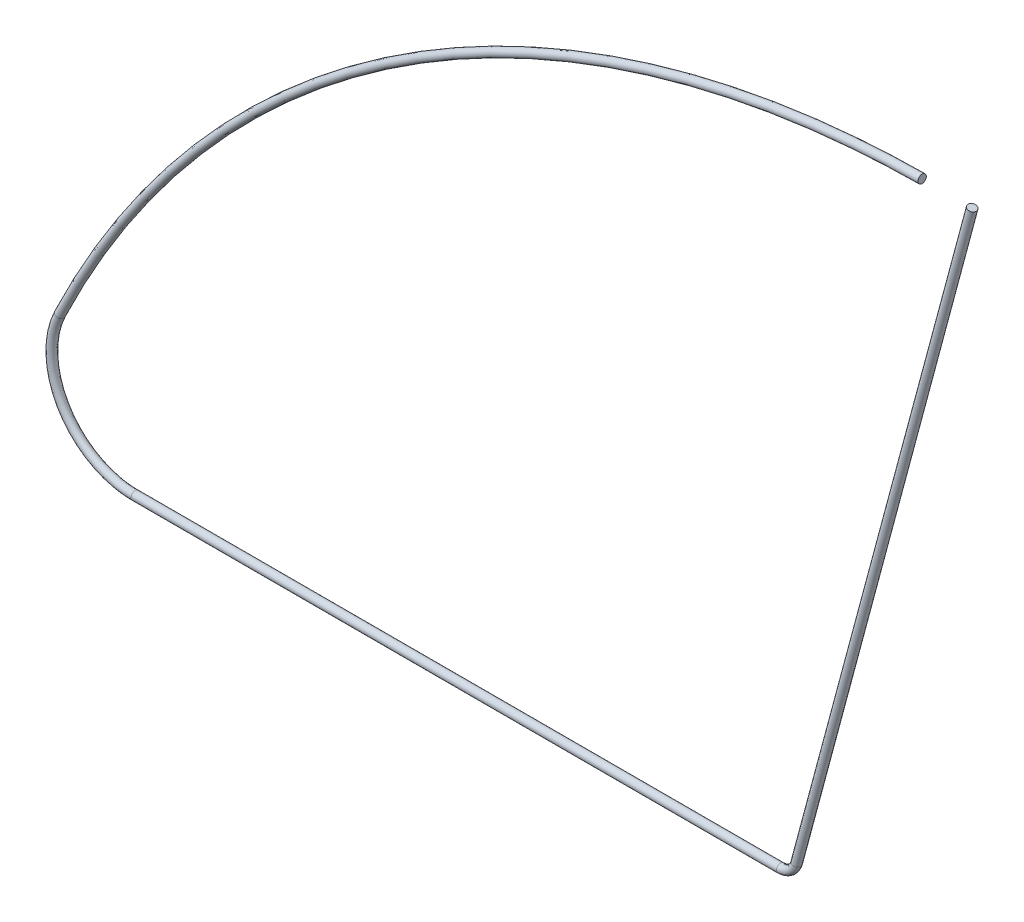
from build123d import *

# Parameters (mm, degrees)
ESQUISSE2_R = 0.5


with BuildPart() as part:
    # Balayage5: sweep along a path in Esquisse1
    with BuildLine(Plane.XY) as balayage5_path:
        Line((6, 0), (-15.037679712, -78.51368956))
        ThreePointArc((-15.037679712, -78.51368956), (-15.752008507, -79.582758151), (-16.969531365, -79.99605147))
        Line((-16.969531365, -79.99605147), (-94.307241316, -79.99605147))
        ThreePointArc((-94.307241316, -79.99605147), (-102.768779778, -75.32543857), (-103.326204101, -65.676524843))
        ThreePointArc((-103.326204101, -65.676524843), (-61.069235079, -18.03997607), (0, 0))
    # Esquisse2 → Balayage5 (sweep)
    with BuildSketch(Plane(origin=(0, 0, 0), x_dir=(0, 0, -1), z_dir=(1, 0, 0))):
        Circle(ESQUISSE2_R)
    sweep(path=balayage5_path.line)


solid = part.part
